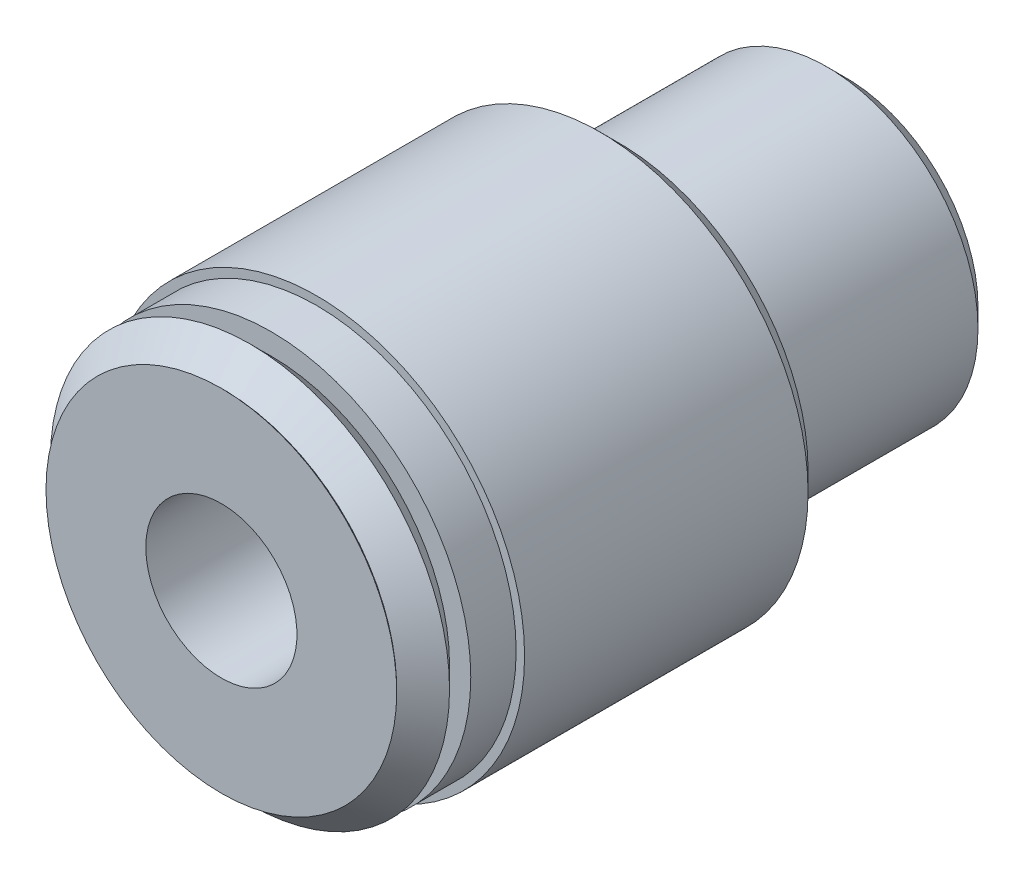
from build123d import *

# Parameters (mm, degrees)
SKETCH4_R                        = 8.7376
DOUBLE_ACTING_STUD_BODY_DEPTH    = 12.7
SKETCH5_R                        = 6.35
DOUBLE_ACTING_STUD_BODY_2_DEPTH  = 9.525
DOUBLE_ACTING_STUD_CHAMFER_SIZE  = 0.79375
SKETCH8_R                        = 2.032
DOUBLE_ACTING_STUD_PORT_A1_DEPTH = 29.988760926
SKETCH3_R                        = 3.175
HOLE_CUT_DEPTH                   = 29.988760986


with BuildPart() as part:
    # Sketch1 → Base (revolve)
    with BuildSketch(Plane(origin=(0, 0, 0), x_dir=(0, 0, -1), z_dir=(1, 0, 0)), mode=Mode.PRIVATE) as base_sk:
        Polygon((0, 0), (0, 7.366), (0.09271, 7.27329), (1.20142, 8.382), (2.093214, 7.490206), (2.093214, 8.382), (3.998214, 8.382), (3.998214, 0), align=None)
    revolve(base_sk.sketch.rotate(Axis((0, 0, -71.294124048), (0, 0, 1)), 90), axis=Axis((0, 0, -71.294124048), (0, 0, 1)))

    # Sketch4 → Double Acting Stud Body (add)
    with BuildSketch(Plane.XY.offset(-3.998214)):
        Circle(SKETCH4_R)
    extrude(amount=-DOUBLE_ACTING_STUD_BODY_DEPTH)

    # Sketch5 → Double Acting Stud Body 2 (add)
    with BuildSketch(Plane(origin=(0, 0, -16.698214), x_dir=(-1, 0, 0), z_dir=(0, 0, -1))):
        with Locations(Location((0, 0, 0), (0, 0, 180))):
            Circle(SKETCH5_R)
    extrude(amount=DOUBLE_ACTING_STUD_BODY_2_DEPTH)

    # Double Acting Stud Chamfer
    double_acting_stud_chamfer_edges = [part.edges().sort_by_distance(p)[0] for p in [
        (-8.7376, 0, -16.698214),
        (-6.35, 0, -26.223214),
    ]]
    chamfer(double_acting_stud_chamfer_edges, length=DOUBLE_ACTING_STUD_CHAMFER_SIZE)

    # Sketch8 → Double Acting Stud Port A1 (cut, through all)
    with BuildSketch(Plane(origin=(0, 0, 0), x_dir=(0, 0, -1), z_dir=(1, 0, 0))):
        with Locations((7.173214, 0)):
            Circle(SKETCH8_R)
    extrude(amount=-DOUBLE_ACTING_STUD_PORT_A1_DEPTH, mode=Mode.SUBTRACT)

    # Sketch3 → Hole Cut (cut, through all)
    with BuildSketch(Plane(origin=(0, 0, 0), x_dir=(-1, 0, 0), z_dir=(0, 0, -1))):
        Circle(SKETCH3_R)
    extrude(amount=HOLE_CUT_DEPTH, mode=Mode.SUBTRACT)


solid = part.part
